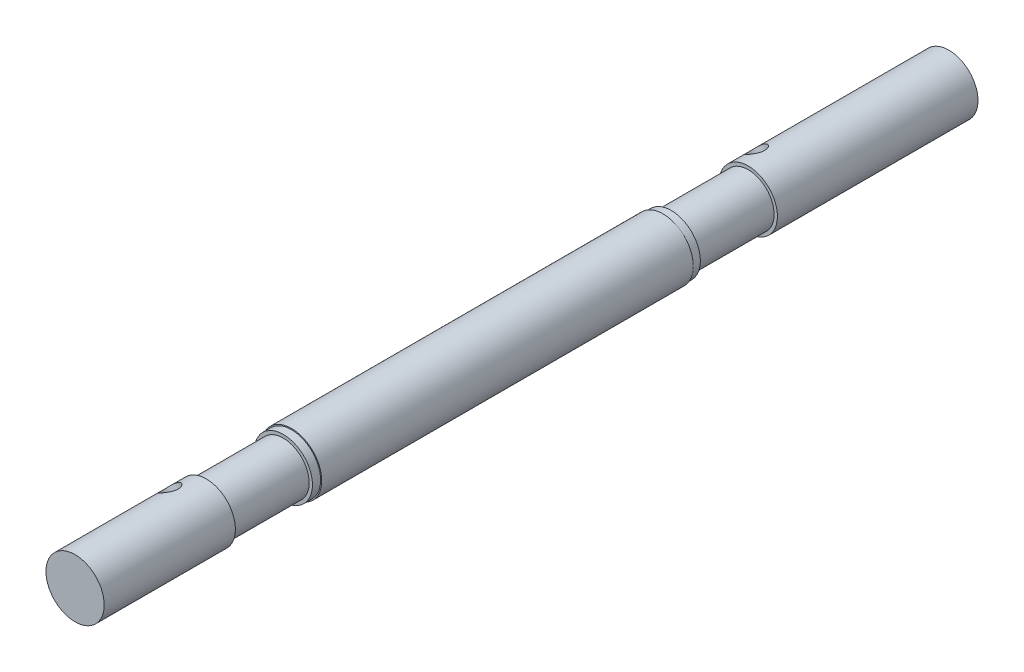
ISO-10303-21;
HEADER;
FILE_DESCRIPTION(('STEP AP214'),'2;1');
FILE_NAME('part.step','',(''),(''),'','','');
FILE_SCHEMA(('AUTOMOTIVE_DESIGN { 1 0 10303 214 1 1 1 1 }'));
ENDSEC;
DATA;
#1=APPLICATION_CONTEXT('core data for automotive mechanical design processes');
#2=APPLICATION_PROTOCOL_DEFINITION('international standard','automotive_design',2000,#1);
#3=PRODUCT_CONTEXT('',#1,'mechanical');
#4=PRODUCT('Part','Part','',(#3));
#5=PRODUCT_RELATED_PRODUCT_CATEGORY('part','',(#4));
#6=PRODUCT_DEFINITION_FORMATION('','',#4);
#7=PRODUCT_DEFINITION_CONTEXT('part definition',#1,'design');
#8=PRODUCT_DEFINITION('design','',#6,#7);
#9=PRODUCT_DEFINITION_SHAPE('','',#8);
#10=(LENGTH_UNIT() NAMED_UNIT(*) SI_UNIT(.MILLI.,.METRE.));
#11=(NAMED_UNIT(*) PLANE_ANGLE_UNIT() SI_UNIT($,.RADIAN.));
#12=(NAMED_UNIT(*) SI_UNIT($,.STERADIAN.) SOLID_ANGLE_UNIT());
#13=UNCERTAINTY_MEASURE_WITH_UNIT(LENGTH_MEASURE(1.E-05),#10,'distance_accuracy_value','');
#14=(GEOMETRIC_REPRESENTATION_CONTEXT(3) GLOBAL_UNCERTAINTY_ASSIGNED_CONTEXT((#13)) GLOBAL_UNIT_ASSIGNED_CONTEXT((#10,
#11,#12)) REPRESENTATION_CONTEXT('',''));
#15=CARTESIAN_POINT('',(0.,0.,0.));
#16=DIRECTION('',(0.,0.,1.));
#17=DIRECTION('',(1.,0.,0.));
#18=AXIS2_PLACEMENT_3D('',#15,#16,#17);
#19=CARTESIAN_POINT('',(0.971463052,-1.682623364,120.45));
#20=DIRECTION('',(-0.500000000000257,0.86602540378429,0.));
#21=DIRECTION('',(-0.86602540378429,-0.500000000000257,0.));
#22=AXIS2_PLACEMENT_3D('',#19,#20,#21);
#23=CONICAL_SURFACE('',#22,0.,1.02974425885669);
#24=CARTESIAN_POINT('',(0.97146305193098,-1.6826233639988,120.45));
#25=VERTEX_POINT('',#24);
#26=VERTEX_LOOP('',#25);
#27=FACE_BOUND('',#26,.T.);
#28=CARTESIAN_POINT('',(-0.0499999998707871,0.0866025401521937,120.45));
#29=DIRECTION('',(-0.50000000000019,0.866025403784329,0.));
#30=DIRECTION('',(-0.866025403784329,-0.500000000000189,0.));
#31=AXIS2_PLACEMENT_3D('',#28,#29,#30);
#32=CIRCLE('',#31,3.4000000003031);
#33=CARTESIAN_POINT('',(-2.994486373,-1.61339746,120.45));
#34=VERTEX_POINT('',#33);
#35=EDGE_CURVE('E42',#34,#34,#32,.F.);
#36=ORIENTED_EDGE('',*,*,#35,.F.);
#37=EDGE_LOOP('',(#36));
#38=FACE_BOUND('',#37,.T.);
#39=ADVANCED_FACE('F16',(#27,#38),#23,.F.);
#40=CARTESIAN_POINT('',(-0.0499999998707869,0.086602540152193,120.45));
#41=DIRECTION('',(-0.500000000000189,0.866025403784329,0.));
#42=DIRECTION('',(-0.866025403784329,-0.500000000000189,0.));
#43=AXIS2_PLACEMENT_3D('',#40,#41,#42);
#44=CYLINDRICAL_SURFACE('',#43,3.40000000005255);
#45=ORIENTED_EDGE('',*,*,#35,.T.);
#46=EDGE_LOOP('',(#45));
#47=FACE_BOUND('',#46,.T.);
#48=CARTESIAN_POINT('',(-8.01720753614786,7.08621078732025,120.45000000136));
#49=CARTESIAN_POINT('',(-8.01720712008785,7.08621157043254,120.542779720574));
#50=CARTESIAN_POINT('',(-8.01455246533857,7.08921896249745,120.63556517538));
#51=CARTESIAN_POINT('',(-8.00395107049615,7.10118428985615,120.820458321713));
#52=CARTESIAN_POINT('',(-7.99600218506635,7.11014463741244,120.912565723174));
#53=CARTESIAN_POINT('',(-7.9642128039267,7.14579737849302,121.187084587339));
#54=CARTESIAN_POINT('',(-7.93242960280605,7.18126122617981,121.367577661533));
#55=CARTESIAN_POINT('',(-7.84832169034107,7.27307684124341,121.717510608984));
#56=CARTESIAN_POINT('',(-7.79604652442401,7.32937820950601,121.886976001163));
#57=CARTESIAN_POINT('',(-7.6716353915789,7.45949653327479,122.211208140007));
#58=CARTESIAN_POINT('',(-7.59950186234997,7.53331133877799,122.36597668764));
#59=CARTESIAN_POINT('',(-7.43351200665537,7.69720098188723,122.661963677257));
#60=CARTESIAN_POINT('',(-7.33902833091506,7.78772465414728,122.8025816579));
#61=CARTESIAN_POINT('',(-7.13080570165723,7.97881913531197,123.060920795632));
#62=CARTESIAN_POINT('',(-7.01706296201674,8.07939191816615,123.178637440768));
#63=CARTESIAN_POINT('',(-6.76897529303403,8.28841677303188,123.390474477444));
#64=CARTESIAN_POINT('',(-6.63420993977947,8.39699827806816,123.48397709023));
#65=CARTESIAN_POINT('',(-6.34862680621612,8.61493723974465,123.640659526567));
#66=CARTESIAN_POINT('',(-6.197813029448,8.72429449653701,123.703846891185));
#67=CARTESIAN_POINT('',(-5.88875860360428,8.93568351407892,123.796101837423));
#68=CARTESIAN_POINT('',(-5.73090736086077,9.03783765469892,123.826191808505));
#69=CARTESIAN_POINT('',(-5.40791009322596,9.23473046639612,123.854640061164));
#70=CARTESIAN_POINT('',(-5.242765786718,9.32947086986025,123.853005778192));
#71=CARTESIAN_POINT('',(-4.91623765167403,9.50546188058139,123.818718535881));
#72=CARTESIAN_POINT('',(-4.7549299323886,9.58707323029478,123.787174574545));
#73=CARTESIAN_POINT('',(-4.43512043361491,9.73915180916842,123.695786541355));
#74=CARTESIAN_POINT('',(-4.27661885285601,9.80961825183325,123.635940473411));
#75=CARTESIAN_POINT('',(-3.96526354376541,9.93959387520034,123.488948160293));
#76=CARTESIAN_POINT('',(-3.81250521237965,9.99895503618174,123.401469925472));
#77=CARTESIAN_POINT('',(-3.51938507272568,10.1058549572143,123.201972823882));
#78=CARTESIAN_POINT('',(-3.37902580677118,10.1533912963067,123.089948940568));
#79=CARTESIAN_POINT('',(-3.10936553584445,10.239274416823,122.838878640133));
#80=CARTESIAN_POINT('',(-2.98079638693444,10.2771399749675,122.698879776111));
#81=CARTESIAN_POINT('',(-2.74641347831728,10.3422457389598,122.398716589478));
#82=CARTESIAN_POINT('',(-2.64061058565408,10.3694808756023,122.23854269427));
#83=CARTESIAN_POINT('',(-2.45491343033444,10.4150238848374,121.899788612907));
#84=CARTESIAN_POINT('',(-2.3753628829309,10.4332147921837,121.721001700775));
#85=CARTESIAN_POINT('',(-2.27986345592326,10.4543412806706,121.444535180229));
#86=CARTESIAN_POINT('',(-2.2520085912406,10.460355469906,121.351042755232));
#87=CARTESIAN_POINT('',(-2.20452729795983,10.4704660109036,121.161901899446));
#88=CARTESIAN_POINT('',(-2.18489707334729,10.4745632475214,121.066254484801));
#89=CARTESIAN_POINT('',(-2.15580959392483,10.4805857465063,120.884006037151));
#90=CARTESIAN_POINT('',(-2.14548006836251,10.4826983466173,120.797548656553));
#91=CARTESIAN_POINT('',(-2.13169223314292,10.4855108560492,120.624062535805));
#92=CARTESIAN_POINT('',(-2.12823395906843,10.4862107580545,120.5370337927));
#93=CARTESIAN_POINT('',(-2.12823567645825,10.4862108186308,120.357220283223));
#94=CARTESIAN_POINT('',(-2.13216748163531,10.4854155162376,120.264434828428));
#95=CARTESIAN_POINT('',(-2.14783045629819,10.4822171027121,120.079541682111));
#96=CARTESIAN_POINT('',(-2.15956478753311,10.479813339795,119.987434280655));
#97=CARTESIAN_POINT('',(-2.20633565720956,10.4701092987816,119.712915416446));
#98=CARTESIAN_POINT('',(-2.252939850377,10.4603161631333,119.532422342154));
#99=CARTESIAN_POINT('',(-2.3745084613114,10.4333843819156,119.182489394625));
#100=CARTESIAN_POINT('',(-2.44940445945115,10.4162634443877,119.013024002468));
#101=CARTESIAN_POINT('',(-2.62429579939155,10.3735794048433,118.688791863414));
#102=CARTESIAN_POINT('',(-2.7242880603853,10.3480173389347,118.534023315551));
#103=CARTESIAN_POINT('',(-2.94921558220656,10.2862107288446,118.238036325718));
#104=CARTESIAN_POINT('',(-3.07485321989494,10.2496473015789,118.097418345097));
#105=CARTESIAN_POINT('',(-3.34445720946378,10.1648684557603,117.839079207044));
#106=CARTESIAN_POINT('',(-3.48842716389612,10.1166507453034,117.721362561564));
#107=CARTESIAN_POINT('',(-3.79349183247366,10.0063129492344,117.509525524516));
#108=CARTESIAN_POINT('',(-3.95490885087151,9.9438934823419,117.416022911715));
#109=CARTESIAN_POINT('',(-4.28644109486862,9.80554071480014,117.259340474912));
#110=CARTESIAN_POINT('',(-4.45655414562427,9.72961078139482,117.196153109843));
#111=CARTESIAN_POINT('',(-4.79414961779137,9.56765630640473,117.103898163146));
#112=CARTESIAN_POINT('',(-4.9615433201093,9.48203019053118,117.073808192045));
#113=CARTESIAN_POINT('',(-5.29355613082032,9.30075275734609,117.045359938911));
#114=CARTESIAN_POINT('',(-5.45817588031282,9.20510379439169,117.046994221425));
#115=CARTESIAN_POINT('',(-5.77385263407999,9.01031763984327,117.081281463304));
#116=CARTESIAN_POINT('',(-5.92518399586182,8.91142673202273,117.112825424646));
#117=CARTESIAN_POINT('',(-6.21679265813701,8.71050287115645,117.204213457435));
#118=CARTESIAN_POINT('',(-6.35706917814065,8.60846969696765,117.264059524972));
#119=CARTESIAN_POINT('',(-6.62530902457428,8.40381590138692,117.411051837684));
#120=CARTESIAN_POINT('',(-6.75309646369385,8.30120388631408,117.498530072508));
#121=CARTESIAN_POINT('',(-6.9922345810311,8.10080435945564,117.698027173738));
#122=CARTESIAN_POINT('',(-7.10358189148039,8.00301783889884,117.81005105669));
#123=CARTESIAN_POINT('',(-7.3127889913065,7.81242675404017,118.061121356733));
#124=CARTESIAN_POINT('',(-7.40986610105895,7.72001538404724,118.201120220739));
#125=CARTESIAN_POINT('',(-7.58344080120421,7.54958671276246,118.501283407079));
#126=CARTESIAN_POINT('',(-7.65992856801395,7.47157628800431,118.661457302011));
#127=CARTESIAN_POINT('',(-7.79221854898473,7.33352933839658,119.000211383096));
#128=CARTESIAN_POINT('',(-7.8477476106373,7.27373199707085,119.178998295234));
#129=CARTESIAN_POINT('',(-7.91379340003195,7.2015903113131,119.455464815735));
#130=CARTESIAN_POINT('',(-7.93292927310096,7.18047438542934,119.548957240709));
#131=CARTESIAN_POINT('',(-7.96542590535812,7.14440964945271,119.738098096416));
#132=CARTESIAN_POINT('',(-7.97878932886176,7.12945799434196,119.833745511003));
#133=CARTESIAN_POINT('',(-7.99854870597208,7.10727874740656,120.01599395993));
#134=CARTESIAN_POINT('',(-8.00554303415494,7.0993894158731,120.102451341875));
#135=CARTESIAN_POINT('',(-8.01487265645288,7.08885505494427,120.275937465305));
#136=CARTESIAN_POINT('',(-8.01720792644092,7.08621005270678,120.362966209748));
#137=CARTESIAN_POINT('',(-8.01720753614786,7.08621078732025,120.45000000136));
#138=B_SPLINE_CURVE_WITH_KNOTS('',3,(#48,#49,#50,#51,#52,#53,#54,#55,#56,#57,#58,#59,#60,#61,
#62,#63,#64,#65,#66,#67,#68,#69,#70,#71,#72,#73,#74,#75,#76,#77,#78,#79,#80,#81,#82,#83,#84,#85,
#86,#87,#88,#89,#90,#91,#92,#93,#94,#95,#96,#97,#98,#99,#100,#101,#102,#103,#104,#105,#106,#107,
#108,#109,#110,#111,#112,#113,#114,#115,#116,#117,#118,#119,#120,#121,#122,#123,#124,#125,#126,
#127,#128,#129,#130,#131,#132,#133,#134,#135,#136,#137),.UNSPECIFIED.,.T.,.F.,(4,2,2,2,2,2,2,2,
2,2,2,2,2,2,2,2,2,2,2,2,2,2,2,2,2,2,2,2,2,2,2,2,2,2,2,2,2,2,2,2,2,2,2,2,4),(0.,0.27825205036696,
0.556616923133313,1.11368727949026,1.66941897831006,2.22508248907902,2.79872517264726,
3.37248075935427,3.95968527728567,4.54674364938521,5.11510863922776,5.68334041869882,
6.23129456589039,6.77928736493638,7.33413195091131,7.88909003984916,8.46783511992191,
9.04685584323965,9.63318173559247,9.92608014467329,10.2188432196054,10.4798615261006,
10.7408811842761,11.0191332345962,11.2974981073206,11.8545684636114,12.4103001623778,
12.9659636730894,13.5396063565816,14.1133619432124,14.7005664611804,15.2876248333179,
15.8559898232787,16.4242216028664,16.9721757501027,17.5201685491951,18.0750131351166,
18.6299712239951,19.2087163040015,19.7877370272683,20.3740629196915,20.6669613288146,
20.9597244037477,21.220742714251,21.4817623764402),.UNSPECIFIED.);
#139=CARTESIAN_POINT('',(-8.01720753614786,7.08621078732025,120.45000000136));
#140=VERTEX_POINT('',#139);
#141=EDGE_CURVE('E20',#140,#140,#138,.T.);
#142=ORIENTED_EDGE('',*,*,#141,.T.);
#143=EDGE_LOOP('',(#142));
#144=FACE_BOUND('',#143,.T.);
#145=ADVANCED_FACE('F38',(#47,#144),#44,.F.);
#146=CARTESIAN_POINT('',(-10.8284,-10.8284,160.5));
#147=DIRECTION('',(0.,0.,1.));
#148=DIRECTION('',(1.,0.,0.));
#149=AXIS2_PLACEMENT_3D('',#146,#147,#148);
#150=PLANE('',#149);
#151=CARTESIAN_POINT('',(0.,0.,160.5));
#152=DIRECTION('',(0.,0.,1.));
#153=DIRECTION('',(1.,0.,0.));
#154=AXIS2_PLACEMENT_3D('',#151,#152,#153);
#155=CIRCLE('',#154,10.7);
#156=CARTESIAN_POINT('',(10.7,0.,160.5));
#157=VERTEX_POINT('',#156);
#158=EDGE_CURVE('E46',#157,#157,#155,.T.);
#159=ORIENTED_EDGE('',*,*,#158,.T.);
#160=EDGE_LOOP('',(#159));
#161=FACE_BOUND('',#160,.T.);
#162=ADVANCED_FACE('F116',(#161),#150,.T.);
#163=CARTESIAN_POINT('',(0.,0.,112.3));
#164=DIRECTION('',(0.,0.,1.));
#165=DIRECTION('',(1.,0.,0.));
#166=AXIS2_PLACEMENT_3D('',#163,#164,#165);
#167=CYLINDRICAL_SURFACE('',#166,10.7);
#168=ORIENTED_EDGE('',*,*,#158,.F.);
#169=EDGE_LOOP('',(#168));
#170=FACE_BOUND('',#169,.T.);
#171=CARTESIAN_POINT('',(0.,0.,112.3));
#172=DIRECTION('',(0.,0.,1.));
#173=DIRECTION('',(1.,0.,0.));
#174=AXIS2_PLACEMENT_3D('',#171,#172,#173);
#175=CIRCLE('',#174,10.7);
#176=CARTESIAN_POINT('',(10.7,0.,112.3));
#177=VERTEX_POINT('',#176);
#178=EDGE_CURVE('E111',#177,#177,#175,.T.);
#179=ORIENTED_EDGE('',*,*,#178,.T.);
#180=EDGE_LOOP('',(#179));
#181=FACE_BOUND('',#180,.T.);
#182=ORIENTED_EDGE('',*,*,#141,.F.);
#183=EDGE_LOOP('',(#182));
#184=FACE_BOUND('',#183,.T.);
#185=ADVANCED_FACE('F118',(#170,#181,#184),#167,.T.);
#186=CARTESIAN_POINT('',(-10.8284,-10.8284,112.3));
#187=DIRECTION('',(0.,0.,1.));
#188=DIRECTION('',(1.,0.,0.));
#189=AXIS2_PLACEMENT_3D('',#186,#187,#188);
#190=PLANE('',#189);
#191=CARTESIAN_POINT('',(0.,0.,112.3));
#192=DIRECTION('',(0.,0.,1.));
#193=DIRECTION('',(1.,0.,0.));
#194=AXIS2_PLACEMENT_3D('',#191,#192,#193);
#195=CIRCLE('',#194,9.5);
#196=CARTESIAN_POINT('',(9.5,0.,112.3));
#197=VERTEX_POINT('',#196);
#198=EDGE_CURVE('E108',#197,#197,#195,.T.);
#199=ORIENTED_EDGE('',*,*,#198,.T.);
#200=EDGE_LOOP('',(#199));
#201=FACE_BOUND('',#200,.T.);
#202=ORIENTED_EDGE('',*,*,#178,.F.);
#203=EDGE_LOOP('',(#202));
#204=FACE_BOUND('',#203,.T.);
#205=ADVANCED_FACE('F121',(#201,#204),#190,.F.);
#206=CARTESIAN_POINT('',(0.,0.,84.));
#207=DIRECTION('',(0.,0.,1.));
#208=DIRECTION('',(1.,0.,0.));
#209=AXIS2_PLACEMENT_3D('',#206,#207,#208);
#210=CYLINDRICAL_SURFACE('',#209,9.5);
#211=CARTESIAN_POINT('',(0.,0.,84.));
#212=DIRECTION('',(0.,0.,1.));
#213=DIRECTION('',(1.,0.,0.));
#214=AXIS2_PLACEMENT_3D('',#211,#212,#213);
#215=CIRCLE('',#214,9.5);
#216=CARTESIAN_POINT('',(9.5,0.,84.));
#217=VERTEX_POINT('',#216);
#218=EDGE_CURVE('E105',#217,#217,#215,.F.);
#219=ORIENTED_EDGE('',*,*,#218,.F.);
#220=EDGE_LOOP('',(#219));
#221=FACE_BOUND('',#220,.T.);
#222=ORIENTED_EDGE('',*,*,#198,.F.);
#223=EDGE_LOOP('',(#222));
#224=FACE_BOUND('',#223,.T.);
#225=ADVANCED_FACE('F137',(#221,#224),#210,.T.);
#226=CARTESIAN_POINT('',(-10.8284,-10.8284,84.));
#227=DIRECTION('',(0.,0.,1.));
#228=DIRECTION('',(1.,0.,0.));
#229=AXIS2_PLACEMENT_3D('',#226,#227,#228);
#230=PLANE('',#229);
#231=ORIENTED_EDGE('',*,*,#218,.T.);
#232=EDGE_LOOP('',(#231));
#233=FACE_BOUND('',#232,.T.);
#234=CARTESIAN_POINT('',(0.,0.,84.));
#235=DIRECTION('',(0.,0.,1.));
#236=DIRECTION('',(1.,0.,0.));
#237=AXIS2_PLACEMENT_3D('',#234,#235,#236);
#238=CIRCLE('',#237,10.7);
#239=CARTESIAN_POINT('',(10.7,0.,84.));
#240=VERTEX_POINT('',#239);
#241=EDGE_CURVE('E102',#240,#240,#238,.T.);
#242=ORIENTED_EDGE('',*,*,#241,.T.);
#243=EDGE_LOOP('',(#242));
#244=FACE_BOUND('',#243,.T.);
#245=ADVANCED_FACE('F139',(#233,#244),#230,.T.);
#246=CARTESIAN_POINT('',(0.,0.,81.));
#247=DIRECTION('',(0.,0.,1.));
#248=DIRECTION('',(1.,0.,0.));
#249=AXIS2_PLACEMENT_3D('',#246,#247,#248);
#250=CYLINDRICAL_SURFACE('',#249,10.7);
#251=CARTESIAN_POINT('',(0.,0.,81.));
#252=DIRECTION('',(0.,0.,1.));
#253=DIRECTION('',(1.,0.,0.));
#254=AXIS2_PLACEMENT_3D('',#251,#252,#253);
#255=CIRCLE('',#254,10.7);
#256=CARTESIAN_POINT('',(10.7,0.,81.));
#257=VERTEX_POINT('',#256);
#258=EDGE_CURVE('E99',#257,#257,#255,.F.);
#259=ORIENTED_EDGE('',*,*,#258,.F.);
#260=EDGE_LOOP('',(#259));
#261=FACE_BOUND('',#260,.T.);
#262=ORIENTED_EDGE('',*,*,#241,.F.);
#263=EDGE_LOOP('',(#262));
#264=FACE_BOUND('',#263,.T.);
#265=ADVANCED_FACE('F142',(#261,#264),#250,.T.);
#266=CARTESIAN_POINT('',(-11.2332,-11.2332,81.));
#267=DIRECTION('',(0.,0.,1.));
#268=DIRECTION('',(1.,0.,0.));
#269=AXIS2_PLACEMENT_3D('',#266,#267,#268);
#270=PLANE('',#269);
#271=ORIENTED_EDGE('',*,*,#258,.T.);
#272=EDGE_LOOP('',(#271));
#273=FACE_BOUND('',#272,.T.);
#274=CARTESIAN_POINT('',(0.,0.,81.));
#275=DIRECTION('',(0.,0.,-1.));
#276=DIRECTION('',(-1.,0.,0.));
#277=AXIS2_PLACEMENT_3D('',#274,#275,#276);
#278=CIRCLE('',#277,11.1);
#279=CARTESIAN_POINT('',(-11.1,0.,81.));
#280=VERTEX_POINT('',#279);
#281=EDGE_CURVE('E96',#280,#280,#278,.F.);
#282=ORIENTED_EDGE('',*,*,#281,.T.);
#283=EDGE_LOOP('',(#282));
#284=FACE_BOUND('',#283,.T.);
#285=ADVANCED_FACE('F144',(#273,#284),#270,.T.);
#286=CARTESIAN_POINT('',(0.,0.,81.));
#287=DIRECTION('',(0.,0.,-1.));
#288=DIRECTION('',(-1.,0.,0.));
#289=AXIS2_PLACEMENT_3D('',#286,#287,#288);
#290=CYLINDRICAL_SURFACE('',#289,11.1);
#291=ORIENTED_EDGE('',*,*,#281,.F.);
#292=EDGE_LOOP('',(#291));
#293=FACE_BOUND('',#292,.T.);
#294=CARTESIAN_POINT('',(0.,0.,-55.5));
#295=DIRECTION('',(0.,0.,-1.));
#296=DIRECTION('',(-1.,0.,0.));
#297=AXIS2_PLACEMENT_3D('',#294,#295,#296);
#298=CIRCLE('',#297,11.1);
#299=CARTESIAN_POINT('',(-11.1,0.,-55.5));
#300=VERTEX_POINT('',#299);
#301=EDGE_CURVE('E93',#300,#300,#298,.T.);
#302=ORIENTED_EDGE('',*,*,#301,.F.);
#303=EDGE_LOOP('',(#302));
#304=FACE_BOUND('',#303,.T.);
#305=ADVANCED_FACE('F147',(#293,#304),#290,.T.);
#306=CARTESIAN_POINT('',(11.2332,-11.2332,-55.5));
#307=DIRECTION('',(0.,0.,-1.));
#308=DIRECTION('',(-1.,0.,0.));
#309=AXIS2_PLACEMENT_3D('',#306,#307,#308);
#310=PLANE('',#309);
#311=CARTESIAN_POINT('',(0.,0.,-55.5));
#312=DIRECTION('',(0.,0.,-1.));
#313=DIRECTION('',(0.,1.,0.));
#314=AXIS2_PLACEMENT_3D('',#311,#312,#313);
#315=CIRCLE('',#314,10.7);
#316=CARTESIAN_POINT('',(0.,10.7,-55.5));
#317=VERTEX_POINT('',#316);
#318=EDGE_CURVE('E90',#317,#317,#315,.F.);
#319=ORIENTED_EDGE('',*,*,#318,.T.);
#320=EDGE_LOOP('',(#319));
#321=FACE_BOUND('',#320,.T.);
#322=ORIENTED_EDGE('',*,*,#301,.T.);
#323=EDGE_LOOP('',(#322));
#324=FACE_BOUND('',#323,.T.);
#325=ADVANCED_FACE('F149',(#321,#324),#310,.T.);
#326=CARTESIAN_POINT('',(0.,0.,-55.5));
#327=DIRECTION('',(0.,0.,-1.));
#328=DIRECTION('',(0.,1.,0.));
#329=AXIS2_PLACEMENT_3D('',#326,#327,#328);
#330=CYLINDRICAL_SURFACE('',#329,10.7);
#331=ORIENTED_EDGE('',*,*,#318,.F.);
#332=EDGE_LOOP('',(#331));
#333=FACE_BOUND('',#332,.T.);
#334=CARTESIAN_POINT('',(0.,0.,-58.5));
#335=DIRECTION('',(0.,0.,-1.));
#336=DIRECTION('',(0.,1.,0.));
#337=AXIS2_PLACEMENT_3D('',#334,#335,#336);
#338=CIRCLE('',#337,10.7);
#339=CARTESIAN_POINT('',(0.,10.7,-58.5));
#340=VERTEX_POINT('',#339);
#341=EDGE_CURVE('E87',#340,#340,#338,.T.);
#342=ORIENTED_EDGE('',*,*,#341,.F.);
#343=EDGE_LOOP('',(#342));
#344=FACE_BOUND('',#343,.T.);
#345=ADVANCED_FACE('F152',(#333,#344),#330,.T.);
#346=CARTESIAN_POINT('',(10.8284,-10.8284,-58.5));
#347=DIRECTION('',(0.,0.,-1.));
#348=DIRECTION('',(-1.,0.,0.));
#349=AXIS2_PLACEMENT_3D('',#346,#347,#348);
#350=PLANE('',#349);
#351=CARTESIAN_POINT('',(0.,0.,-58.5));
#352=DIRECTION('',(0.,0.,-1.));
#353=DIRECTION('',(0.,1.,0.));
#354=AXIS2_PLACEMENT_3D('',#351,#352,#353);
#355=CIRCLE('',#354,9.5);
#356=CARTESIAN_POINT('',(0.,9.5,-58.5));
#357=VERTEX_POINT('',#356);
#358=EDGE_CURVE('E82',#357,#357,#355,.F.);
#359=ORIENTED_EDGE('',*,*,#358,.T.);
#360=EDGE_LOOP('',(#359));
#361=FACE_BOUND('',#360,.T.);
#362=ORIENTED_EDGE('',*,*,#341,.T.);
#363=EDGE_LOOP('',(#362));
#364=FACE_BOUND('',#363,.T.);
#365=ADVANCED_FACE('F154',(#361,#364),#350,.T.);
#366=CARTESIAN_POINT('',(0.,0.,-58.5));
#367=DIRECTION('',(0.,0.,-1.));
#368=DIRECTION('',(0.,1.,0.));
#369=AXIS2_PLACEMENT_3D('',#366,#367,#368);
#370=CYLINDRICAL_SURFACE('',#369,9.5);
#371=CARTESIAN_POINT('',(0.,0.,-86.8));
#372=DIRECTION('',(0.,0.,-1.));
#373=DIRECTION('',(0.,1.,0.));
#374=AXIS2_PLACEMENT_3D('',#371,#372,#373);
#375=CIRCLE('',#374,9.5);
#376=CARTESIAN_POINT('',(0.,9.50000000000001,-86.8));
#377=VERTEX_POINT('',#376);
#378=EDGE_CURVE('E78',#377,#377,#375,.F.);
#379=ORIENTED_EDGE('',*,*,#378,.T.);
#380=EDGE_LOOP('',(#379));
#381=FACE_BOUND('',#380,.T.);
#382=ORIENTED_EDGE('',*,*,#358,.F.);
#383=EDGE_LOOP('',(#382));
#384=FACE_BOUND('',#383,.T.);
#385=ADVANCED_FACE('F156',(#381,#384),#370,.T.);
#386=CARTESIAN_POINT('',(-10.8284,-10.8284,-160.5));
#387=DIRECTION('',(0.,0.,1.));
#388=DIRECTION('',(1.,0.,0.));
#389=AXIS2_PLACEMENT_3D('',#386,#387,#388);
#390=PLANE('',#389);
#391=CARTESIAN_POINT('',(0.,0.,-160.5));
#392=DIRECTION('',(0.,0.,-1.));
#393=DIRECTION('',(0.,1.,0.));
#394=AXIS2_PLACEMENT_3D('',#391,#392,#393);
#395=CIRCLE('',#394,10.7);
#396=CARTESIAN_POINT('',(0.,10.7,-160.5));
#397=VERTEX_POINT('',#396);
#398=EDGE_CURVE('E74',#397,#397,#395,.T.);
#399=ORIENTED_EDGE('',*,*,#398,.T.);
#400=EDGE_LOOP('',(#399));
#401=FACE_BOUND('',#400,.T.);
#402=ADVANCED_FACE('F158',(#401),#390,.F.);
#403=CARTESIAN_POINT('',(10.8284,-10.8284,-86.8));
#404=DIRECTION('',(0.,0.,-1.));
#405=DIRECTION('',(-1.,0.,0.));
#406=AXIS2_PLACEMENT_3D('',#403,#404,#405);
#407=PLANE('',#406);
#408=ORIENTED_EDGE('',*,*,#378,.F.);
#409=EDGE_LOOP('',(#408));
#410=FACE_BOUND('',#409,.T.);
#411=CARTESIAN_POINT('',(0.,0.,-86.8));
#412=DIRECTION('',(0.,0.,-1.));
#413=DIRECTION('',(0.,1.,0.));
#414=AXIS2_PLACEMENT_3D('',#411,#412,#413);
#415=CIRCLE('',#414,10.7);
#416=CARTESIAN_POINT('',(0.,10.7,-86.8));
#417=VERTEX_POINT('',#416);
#418=EDGE_CURVE('E53',#417,#417,#415,.F.);
#419=ORIENTED_EDGE('',*,*,#418,.T.);
#420=EDGE_LOOP('',(#419));
#421=FACE_BOUND('',#420,.T.);
#422=ADVANCED_FACE('F18',(#410,#421),#407,.F.);
#423=CARTESIAN_POINT('',(0.971463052,-1.682623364,-94.95));
#424=DIRECTION('',(-0.500000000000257,0.86602540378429,0.));
#425=DIRECTION('',(-0.86602540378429,-0.500000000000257,0.));
#426=AXIS2_PLACEMENT_3D('',#423,#424,#425);
#427=CONICAL_SURFACE('',#426,0.,1.02974425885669);
#428=CARTESIAN_POINT('',(0.97146305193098,-1.6826233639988,-94.95));
#429=VERTEX_POINT('',#428);
#430=VERTEX_LOOP('',#429);
#431=FACE_BOUND('',#430,.T.);
#432=CARTESIAN_POINT('',(-0.0499999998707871,0.0866025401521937,-94.95));
#433=DIRECTION('',(-0.50000000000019,0.866025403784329,0.));
#434=DIRECTION('',(-0.866025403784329,-0.500000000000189,0.));
#435=AXIS2_PLACEMENT_3D('',#432,#433,#434);
#436=CIRCLE('',#435,3.4000000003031);
#437=CARTESIAN_POINT('',(-2.994486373,-1.61339746,-94.95));
#438=VERTEX_POINT('',#437);
#439=EDGE_CURVE('E30',#438,#438,#436,.F.);
#440=ORIENTED_EDGE('',*,*,#439,.F.);
#441=EDGE_LOOP('',(#440));
#442=FACE_BOUND('',#441,.T.);
#443=ADVANCED_FACE('F66',(#431,#442),#427,.F.);
#444=CARTESIAN_POINT('',(0.,0.,-86.8));
#445=DIRECTION('',(0.,0.,-1.));
#446=DIRECTION('',(0.,1.,0.));
#447=AXIS2_PLACEMENT_3D('',#444,#445,#446);
#448=CYLINDRICAL_SURFACE('',#447,10.7);
#449=ORIENTED_EDGE('',*,*,#398,.F.);
#450=EDGE_LOOP('',(#449));
#451=FACE_BOUND('',#450,.T.);
#452=ORIENTED_EDGE('',*,*,#418,.F.);
#453=EDGE_LOOP('',(#452));
#454=FACE_BOUND('',#453,.T.);
#455=CARTESIAN_POINT('',(-2.12823479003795,10.4862107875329,-94.9500000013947));
#456=CARTESIAN_POINT('',(-2.12823567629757,10.4862108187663,-95.0427797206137));
#457=CARTESIAN_POINT('',(-2.13216748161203,10.4854155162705,-95.1355651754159));
#458=CARTESIAN_POINT('',(-2.14783045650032,10.4822171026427,-95.3204583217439));
#459=CARTESIAN_POINT('',(-2.15956478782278,10.4798133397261,-95.4125657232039));
#460=CARTESIAN_POINT('',(-2.20633565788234,10.4701092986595,-95.6870845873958));
#461=CARTESIAN_POINT('',(-2.25293985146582,10.4603161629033,-95.867577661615));
#462=CARTESIAN_POINT('',(-2.37450846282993,10.4333843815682,-96.2175106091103));
#463=CARTESIAN_POINT('',(-2.44940446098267,10.416263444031,-96.3869760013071));
#464=CARTESIAN_POINT('',(-2.62429580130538,10.3735794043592,-96.7112081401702));
#465=CARTESIAN_POINT('',(-2.72428806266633,10.3480173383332,-96.8659766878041));
#466=CARTESIAN_POINT('',(-2.94921558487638,10.286210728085,-97.1619636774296));
#467=CARTESIAN_POINT('',(-3.07485322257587,10.2496473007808,-97.3025816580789));
#468=CARTESIAN_POINT('',(-3.34445721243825,10.1648684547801,-97.5609207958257));
#469=CARTESIAN_POINT('',(-3.48842716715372,10.1166507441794,-97.6786374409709));
#470=CARTESIAN_POINT('',(-3.79349183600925,10.0063129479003,-97.89047447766));
#471=CARTESIAN_POINT('',(-3.95490885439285,9.94389348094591,-97.9839770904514));
#472=CARTESIAN_POINT('',(-4.28644109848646,9.805540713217,-98.1406595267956));
#473=CARTESIAN_POINT('',(-4.4565541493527,9.7296107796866,-98.2038468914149));
#474=CARTESIAN_POINT('',(-4.79414962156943,9.56765630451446,-98.2961018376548));
#475=CARTESIAN_POINT('',(-4.96154332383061,9.48203018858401,-98.3261918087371));
#476=CARTESIAN_POINT('',(-5.29355613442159,9.30075275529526,-98.3546400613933));
#477=CARTESIAN_POINT('',(-5.45817588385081,9.20510379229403,-98.3530057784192));
#478=CARTESIAN_POINT('',(-5.77385263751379,9.010317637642,-98.3187185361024));
#479=CARTESIAN_POINT('',(-5.92518399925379,8.9114267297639,-98.2871745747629));
#480=CARTESIAN_POINT('',(-6.21679266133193,8.71050286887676,-98.195786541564));
#481=CARTESIAN_POINT('',(-6.3570691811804,8.60846969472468,-98.1359404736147));
#482=CARTESIAN_POINT('',(-6.62530902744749,8.40381589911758,-97.9889481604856));
#483=CARTESIAN_POINT('',(-6.75309646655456,8.30120388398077,-97.9014699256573));
#484=CARTESIAN_POINT('',(-6.99223458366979,8.10080435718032,-97.7019728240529));
#485=CARTESIAN_POINT('',(-7.10358189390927,8.0030178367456,-97.5899489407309));
#486=CARTESIAN_POINT('',(-7.31278899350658,7.81242675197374,-97.3388786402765));
#487=CARTESIAN_POINT('',(-7.40986610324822,7.72001538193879,-97.198879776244));
#488=CARTESIAN_POINT('',(-7.58344080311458,7.54958671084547,-96.8987165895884));
#489=CARTESIAN_POINT('',(-7.65992856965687,7.47157628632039,-96.7385426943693));
#490=CARTESIAN_POINT('',(-7.79221855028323,7.33352933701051,-96.3997886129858));
#491=CARTESIAN_POINT('',(-7.8477476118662,7.27373199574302,-96.2210017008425));
#492=CARTESIAN_POINT('',(-7.91379340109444,7.20159031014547,-95.9445351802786));
#493=CARTESIAN_POINT('',(-7.93292927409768,7.1804743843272,-95.8510427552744));
#494=CARTESIAN_POINT('',(-7.96542590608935,7.14440964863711,-95.6619018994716));
#495=CARTESIAN_POINT('',(-7.97878932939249,7.12945799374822,-95.5662544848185));
#496=CARTESIAN_POINT('',(-7.99854870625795,7.10727874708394,-95.3840060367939));
#497=CARTESIAN_POINT('',(-8.0055430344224,7.0993894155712,-95.2975486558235));
#498=CARTESIAN_POINT('',(-8.01487265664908,7.08885505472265,-95.1240625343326));
#499=CARTESIAN_POINT('',(-8.01720792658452,7.08621005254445,-95.0370337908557));
#500=CARTESIAN_POINT('',(-8.01720712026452,7.08621157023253,-94.8572202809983));
#501=CARTESIAN_POINT('',(-8.0145524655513,7.08921896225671,-94.7644348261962));
#502=CARTESIAN_POINT('',(-8.00395107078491,7.10118428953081,-94.5795416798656));
#503=CARTESIAN_POINT('',(-7.99600218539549,7.11014463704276,-94.4874342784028));
#504=CARTESIAN_POINT('',(-7.96421280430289,7.14579737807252,-94.2129154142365));
#505=CARTESIAN_POINT('',(-7.93242960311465,7.18126122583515,-94.032422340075));
#506=CARTESIAN_POINT('',(-7.84832169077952,7.27307684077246,-93.6824893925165));
#507=CARTESIAN_POINT('',(-7.79604652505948,7.32937820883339,-93.5130240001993));
#508=CARTESIAN_POINT('',(-7.67163539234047,7.45949653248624,-93.1887918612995));
#509=CARTESIAN_POINT('',(-7.59950186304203,7.53331133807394,-93.0340233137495));
#510=CARTESIAN_POINT('',(-7.43351200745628,7.69720098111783,-92.7380363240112));
#511=CARTESIAN_POINT('',(-7.33902833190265,7.7877246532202,-92.597418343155));
#512=CARTESIAN_POINT('',(-7.13080570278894,7.97881913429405,-92.339079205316));
#513=CARTESIAN_POINT('',(-7.01706296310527,8.07939191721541,-92.2213625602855));
#514=CARTESIAN_POINT('',(-6.76897529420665,8.28841677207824,-92.0095255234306));
#515=CARTESIAN_POINT('',(-6.63420994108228,8.39699827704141,-91.9160229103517));
#516=CARTESIAN_POINT('',(-6.34862680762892,8.61493723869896,-91.7593404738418));
#517=CARTESIAN_POINT('',(-6.19781303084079,8.72429449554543,-91.6961531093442));
#518=CARTESIAN_POINT('',(-5.88875860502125,8.93568351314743,-91.6038981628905));
#519=CARTESIAN_POINT('',(-5.73090736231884,9.03783765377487,-91.573808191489));
#520=CARTESIAN_POINT('',(-5.40791009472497,9.23473046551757,-91.545359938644));
#521=CARTESIAN_POINT('',(-5.24276578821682,9.32947086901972,-91.5469942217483));
#522=CARTESIAN_POINT('',(-4.91623765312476,9.50546187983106,-91.5812814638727));
#523=CARTESIAN_POINT('',(-4.7549299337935,9.58707322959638,-91.6128254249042));
#524=CARTESIAN_POINT('',(-4.43512043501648,9.73915180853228,-91.7042134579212));
#525=CARTESIAN_POINT('',(-4.27661885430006,9.80961825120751,-91.7640595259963));
#526=CARTESIAN_POINT('',(-3.96526354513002,9.93959387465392,-91.9110518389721));
#527=CARTESIAN_POINT('',(-3.81250521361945,9.99895503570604,-91.9985300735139));
#528=CARTESIAN_POINT('',(-3.51938507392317,10.1058549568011,-92.1980271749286));
#529=CARTESIAN_POINT('',(-3.37902580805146,10.1533912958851,-92.3100510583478));
#530=CARTESIAN_POINT('',(-3.1093655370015,10.2392744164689,-92.5611213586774));
#531=CARTESIAN_POINT('',(-2.98079638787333,10.2771399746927,-92.701120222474));
#532=CARTESIAN_POINT('',(-2.74641347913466,10.3422457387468,-93.0012834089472));
#533=CARTESIAN_POINT('',(-2.64061058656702,10.3694808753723,-93.1614573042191));
#534=CARTESIAN_POINT('',(-2.4549134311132,10.4150238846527,-93.5002113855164));
#535=CARTESIAN_POINT('',(-2.37536288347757,10.4332147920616,-93.6789982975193));
#536=CARTESIAN_POINT('',(-2.27986345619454,10.4543412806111,-93.9554648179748));
#537=CARTESIAN_POINT('',(-2.25200859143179,10.4603554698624,-94.0489572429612));
#538=CARTESIAN_POINT('',(-2.2045272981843,10.4704660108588,-94.2380980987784));
#539=CARTESIAN_POINT('',(-2.18489707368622,10.4745632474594,-94.3337455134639));
#540=CARTESIAN_POINT('',(-2.1558095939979,10.4805857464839,-94.5159939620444));
#541=CARTESIAN_POINT('',(-2.14548006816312,10.4826983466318,-94.602451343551));
#542=CARTESIAN_POINT('',(-2.13169223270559,10.4855108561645,-94.7759374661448));
#543=CARTESIAN_POINT('',(-2.12823395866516,10.4862107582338,-94.8629662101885));
#544=CARTESIAN_POINT('',(-2.12823479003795,10.4862107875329,-94.9500000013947));
#545=B_SPLINE_CURVE_WITH_KNOTS('',3,(#455,#456,#457,#458,#459,#460,#461,#462,#463,#464,#465,
#466,#467,#468,#469,#470,#471,#472,#473,#474,#475,#476,#477,#478,#479,#480,#481,#482,#483,#484,
#485,#486,#487,#488,#489,#490,#491,#492,#493,#494,#495,#496,#497,#498,#499,#500,#501,#502,#503,
#504,#505,#506,#507,#508,#509,#510,#511,#512,#513,#514,#515,#516,#517,#518,#519,#520,#521,#522,
#523,#524,#525,#526,#527,#528,#529,#530,#531,#532,#533,#534,#535,#536,#537,#538,#539,#540,#541,
#542,#543,#544),.UNSPECIFIED.,.T.,.F.,(4,2,2,2,2,2,2,2,2,2,2,2,2,2,2,2,2,2,2,2,2,2,2,2,2,2,2,2,
2,2,2,2,2,2,2,2,2,2,2,2,2,2,2,2,4),(0.,0.278252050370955,0.556616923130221,1.11368727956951,
1.66941897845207,2.22508248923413,2.79872517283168,3.37248075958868,3.95968527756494,
4.54674364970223,5.11510863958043,5.68334041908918,6.23129456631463,6.77928736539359,
7.33413195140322,7.88909004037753,8.46783512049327,9.04685584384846,9.63318173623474,
9.9260801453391,10.2188432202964,10.4798615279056,10.7408811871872,11.0191332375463,
11.2974981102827,11.854568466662,12.4103001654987,12.9659636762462,13.5396063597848,
14.1133619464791,14.7005664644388,15.2876248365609,15.8559898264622,16.4242216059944,
16.9721757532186,17.5201685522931,18.0750131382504,18.6299712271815,19.2087163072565,
19.7877370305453,20.3740629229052,20.6669613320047,20.9597244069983,21.2207427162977,
21.4817623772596),.UNSPECIFIED.);
#546=CARTESIAN_POINT('',(-2.12823479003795,10.4862107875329,-94.9500000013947));
#547=VERTEX_POINT('',#546);
#548=EDGE_CURVE('E10',#547,#547,#545,.T.);
#549=ORIENTED_EDGE('',*,*,#548,.F.);
#550=EDGE_LOOP('',(#549));
#551=FACE_BOUND('',#550,.T.);
#552=ADVANCED_FACE('F55',(#451,#454,#551),#448,.T.);
#553=CARTESIAN_POINT('',(-0.0499999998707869,0.086602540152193,-94.95));
#554=DIRECTION('',(-0.500000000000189,0.866025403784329,0.));
#555=DIRECTION('',(-0.866025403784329,-0.500000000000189,0.));
#556=AXIS2_PLACEMENT_3D('',#553,#554,#555);
#557=CYLINDRICAL_SURFACE('',#556,3.40000000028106);
#558=ORIENTED_EDGE('',*,*,#548,.T.);
#559=EDGE_LOOP('',(#558));
#560=FACE_BOUND('',#559,.T.);
#561=ORIENTED_EDGE('',*,*,#439,.T.);
#562=EDGE_LOOP('',(#561));
#563=FACE_BOUND('',#562,.T.);
#564=ADVANCED_FACE('F58',(#560,#563),#557,.F.);
#565=CLOSED_SHELL('',(#39,#145,#162,#185,#205,#225,#245,#265,#285,#305,#325,#345,#365,#385,#402,
#422,#443,#552,#564));
#566=MANIFOLD_SOLID_BREP('B1',#565);
#567=ADVANCED_BREP_SHAPE_REPRESENTATION('',(#18,#566),#14);
#568=SHAPE_DEFINITION_REPRESENTATION(#9,#567);
ENDSEC;
END-ISO-10303-21;
